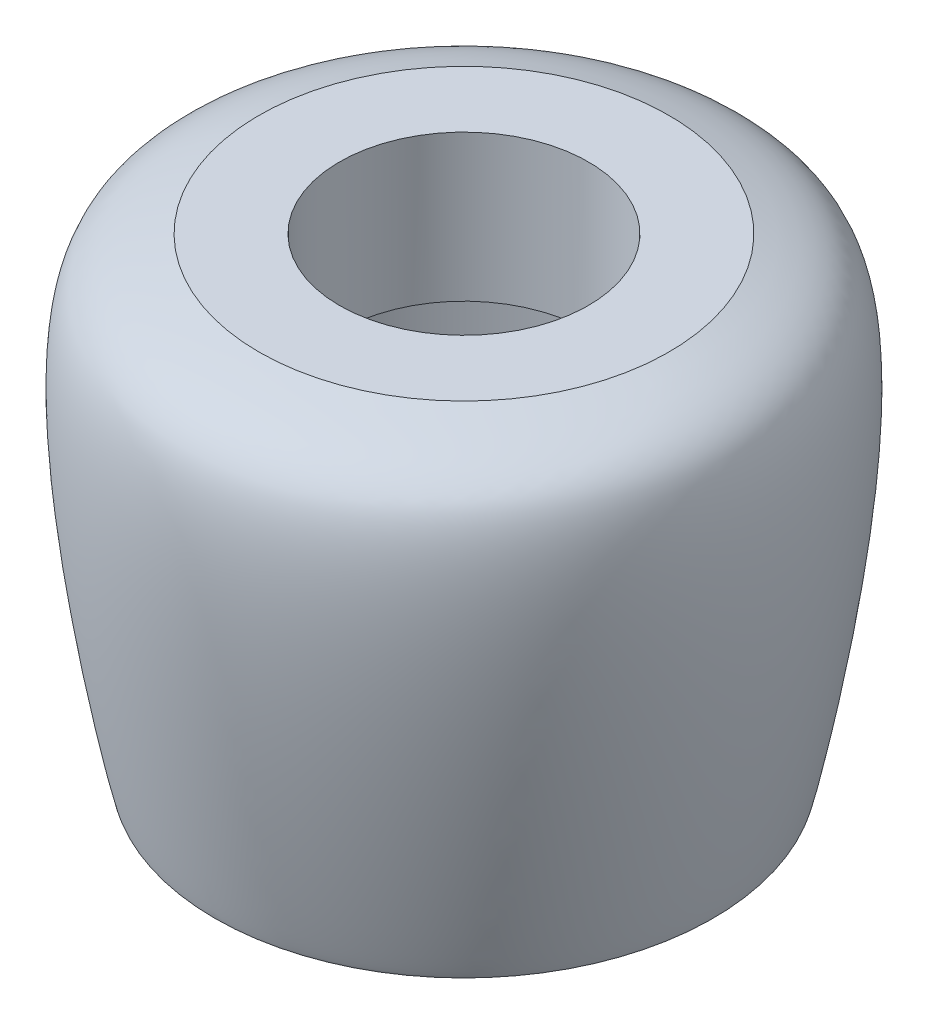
from build123d import *

# Parameters (mm, degrees)
ESQUISSE2_R             = 8.421029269
ENL_V_MAT_EXTRU_1_DEPTH = 11
ESQUISSE3_R             = 4.25
ENL_V_MAT_EXTRU_2_DEPTH = 11


with BuildPart() as part:
    # Esquisse1 → R_volution1 (revolve)
    with BuildSketch(Plane.XY):
        with BuildLine():
            Line((0, -3.714330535), (7, -3.714330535))
            add(Edge.make_bspline(
                [(7, -3.714330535), (8.007056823, -4.018184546), (9.014113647, -4.322038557), (11.215842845, -7.425458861), (8.678338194, -19.233325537), (8.5, -19.714330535)],
                knots=[0, 0, 0, 0, 0.220683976, 0.220683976, 1, 1, 1, 1], degree=3))
            Line((8.5, -19.714330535), (0, -19.714330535))
            Line((0, -19.714330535), (0, -3.714330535))
        make_face()
    revolve(axis=Axis((0, 84.344933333, 0), (0, -1, 0)))

    # Esquisse2 → Enl_v. mat.-Extru.1 (cut)
    with BuildSketch(Plane.XZ.offset(19.714330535)):
        with Locations(Location((0, 0, 0), (0, 0, 270))):
            Circle(ESQUISSE2_R)
    extrude(amount=-ENL_V_MAT_EXTRU_1_DEPTH, mode=Mode.SUBTRACT)

    # Esquisse3 → Enl_v. mat.-Extru.2 (cut)
    with BuildSketch(Plane(origin=(0, -3.714330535, 0), x_dir=(1, 0, 0), z_dir=(0, 1, 0))):
        with Locations(Location((0, 0, 0), (0, 0, 270))):
            Circle(ESQUISSE3_R)
    extrude(amount=-ENL_V_MAT_EXTRU_2_DEPTH, mode=Mode.SUBTRACT)


solid = part.part
